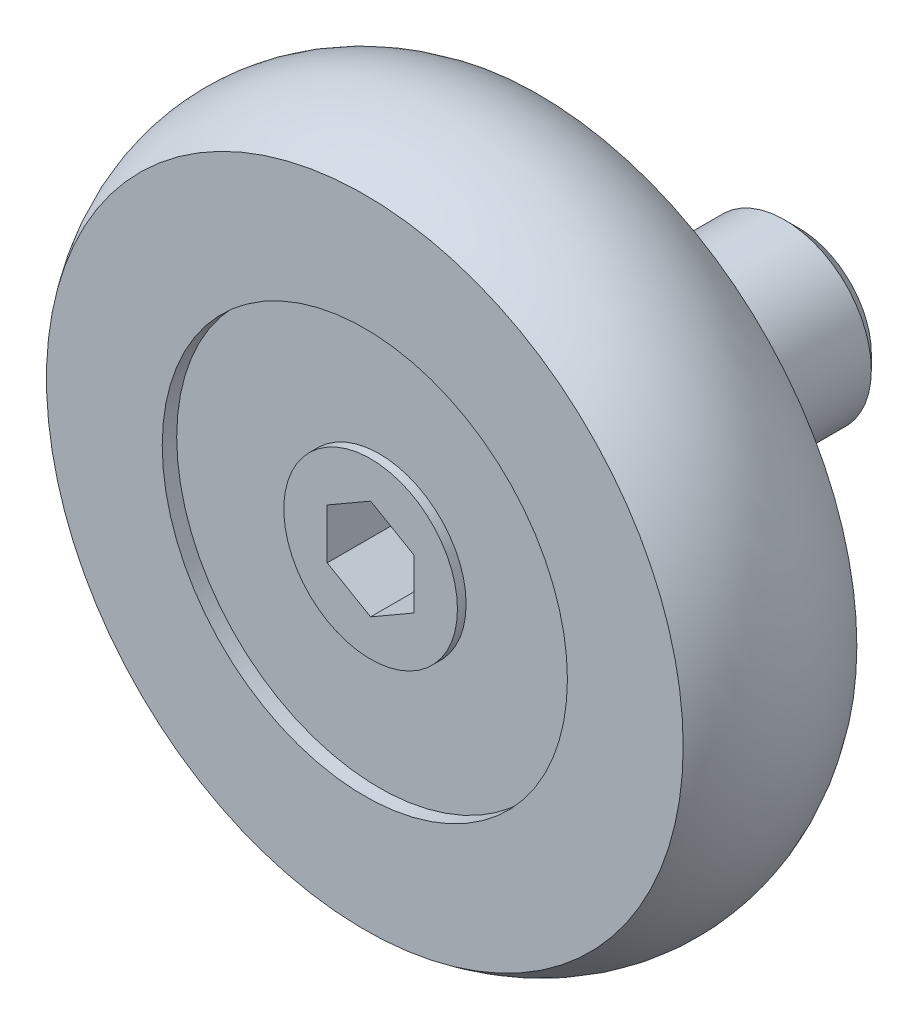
ISO-10303-21;
HEADER;
FILE_DESCRIPTION(('STEP AP214'),'2;1');
FILE_NAME('part.step','',(''),(''),'','','');
FILE_SCHEMA(('AUTOMOTIVE_DESIGN { 1 0 10303 214 1 1 1 1 }'));
ENDSEC;
DATA;
#1=APPLICATION_CONTEXT('core data for automotive mechanical design processes');
#2=APPLICATION_PROTOCOL_DEFINITION('international standard','automotive_design',2000,#1);
#3=PRODUCT_CONTEXT('',#1,'mechanical');
#4=PRODUCT('Part','Part','',(#3));
#5=PRODUCT_RELATED_PRODUCT_CATEGORY('part','',(#4));
#6=PRODUCT_DEFINITION_FORMATION('','',#4);
#7=PRODUCT_DEFINITION_CONTEXT('part definition',#1,'design');
#8=PRODUCT_DEFINITION('design','',#6,#7);
#9=PRODUCT_DEFINITION_SHAPE('','',#8);
#10=(LENGTH_UNIT() NAMED_UNIT(*) SI_UNIT(.MILLI.,.METRE.));
#11=(NAMED_UNIT(*) PLANE_ANGLE_UNIT() SI_UNIT($,.RADIAN.));
#12=(NAMED_UNIT(*) SI_UNIT($,.STERADIAN.) SOLID_ANGLE_UNIT());
#13=UNCERTAINTY_MEASURE_WITH_UNIT(LENGTH_MEASURE(1.E-05),#10,'distance_accuracy_value','');
#14=(GEOMETRIC_REPRESENTATION_CONTEXT(3) GLOBAL_UNCERTAINTY_ASSIGNED_CONTEXT((#13)) GLOBAL_UNIT_ASSIGNED_CONTEXT((#10,
#11,#12)) REPRESENTATION_CONTEXT('',''));
#15=CARTESIAN_POINT('',(0.,0.,0.));
#16=DIRECTION('',(0.,0.,1.));
#17=DIRECTION('',(1.,0.,0.));
#18=AXIS2_PLACEMENT_3D('',#15,#16,#17);
#19=CARTESIAN_POINT('',(0.,0.,-8.));
#20=DIRECTION('',(0.,0.,1.));
#21=DIRECTION('',(1.,0.,0.));
#22=AXIS2_PLACEMENT_3D('',#19,#20,#21);
#23=PLANE('',#22);
#24=CARTESIAN_POINT('',(0.,0.,-8.));
#25=DIRECTION('',(0.,0.,1.));
#26=DIRECTION('',(1.,0.,0.));
#27=AXIS2_PLACEMENT_3D('',#24,#25,#26);
#28=CIRCLE('',#27,2.5);
#29=CARTESIAN_POINT('',(2.5,0.,-8.));
#30=VERTEX_POINT('',#29);
#31=EDGE_CURVE('E9',#30,#30,#28,.T.);
#32=ORIENTED_EDGE('',*,*,#31,.F.);
#33=EDGE_LOOP('',(#32));
#34=FACE_BOUND('',#33,.T.);
#35=ADVANCED_FACE('F14',(#34),#23,.F.);
#36=CARTESIAN_POINT('',(0.,0.,-8.));
#37=DIRECTION('',(0.,0.,1.));
#38=DIRECTION('',(1.,0.,0.));
#39=AXIS2_PLACEMENT_3D('',#36,#37,#38);
#40=CONICAL_SURFACE('',#39,2.5,0.785398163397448);
#41=CARTESIAN_POINT('',(0.,0.,-7.5));
#42=DIRECTION('',(0.,0.,1.));
#43=DIRECTION('',(1.,0.,0.));
#44=AXIS2_PLACEMENT_3D('',#41,#42,#43);
#45=CIRCLE('',#44,3.);
#46=CARTESIAN_POINT('',(3.,0.,-7.5));
#47=VERTEX_POINT('',#46);
#48=EDGE_CURVE('E21',#47,#47,#45,.T.);
#49=ORIENTED_EDGE('',*,*,#48,.F.);
#50=EDGE_LOOP('',(#49));
#51=FACE_BOUND('',#50,.T.);
#52=ORIENTED_EDGE('',*,*,#31,.T.);
#53=EDGE_LOOP('',(#52));
#54=FACE_BOUND('',#53,.T.);
#55=ADVANCED_FACE('F163',(#51,#54),#40,.T.);
#56=CARTESIAN_POINT('',(0.,0.,10.));
#57=DIRECTION('',(0.,0.,1.));
#58=DIRECTION('',(1.,0.,0.));
#59=AXIS2_PLACEMENT_3D('',#56,#57,#58);
#60=CYLINDRICAL_SURFACE('',#59,3.);
#61=CARTESIAN_POINT('',(0.,0.,-2.));
#62=DIRECTION('',(0.,0.,1.));
#63=DIRECTION('',(1.,0.,0.));
#64=AXIS2_PLACEMENT_3D('',#61,#62,#63);
#65=CIRCLE('',#64,3.);
#66=CARTESIAN_POINT('',(3.,0.,-2.));
#67=VERTEX_POINT('',#66);
#68=EDGE_CURVE('E156',#67,#67,#65,.T.);
#69=ORIENTED_EDGE('',*,*,#68,.F.);
#70=EDGE_LOOP('',(#69));
#71=FACE_BOUND('',#70,.T.);
#72=ORIENTED_EDGE('',*,*,#48,.T.);
#73=EDGE_LOOP('',(#72));
#74=FACE_BOUND('',#73,.T.);
#75=ADVANCED_FACE('F161',(#71,#74),#60,.T.);
#76=CARTESIAN_POINT('',(0.,2.35,-2.));
#77=DIRECTION('',(0.,0.,-1.));
#78=DIRECTION('',(-1.,0.,0.));
#79=AXIS2_PLACEMENT_3D('',#76,#77,#78);
#80=PLANE('',#79);
#81=CARTESIAN_POINT('',(0.,0.,-2.));
#82=DIRECTION('',(0.,0.,1.));
#83=DIRECTION('',(1.,0.,0.));
#84=AXIS2_PLACEMENT_3D('',#81,#82,#83);
#85=CIRCLE('',#84,2.35);
#86=CARTESIAN_POINT('',(2.35,0.,-2.));
#87=VERTEX_POINT('',#86);
#88=EDGE_CURVE('E153',#87,#87,#85,.T.);
#89=ORIENTED_EDGE('',*,*,#88,.F.);
#90=EDGE_LOOP('',(#89));
#91=FACE_BOUND('',#90,.T.);
#92=ORIENTED_EDGE('',*,*,#68,.T.);
#93=EDGE_LOOP('',(#92));
#94=FACE_BOUND('',#93,.T.);
#95=ADVANCED_FACE('F188',(#91,#94),#80,.F.);
#96=CARTESIAN_POINT('',(0.,0.,10.));
#97=DIRECTION('',(0.,0.,1.));
#98=DIRECTION('',(1.,0.,0.));
#99=AXIS2_PLACEMENT_3D('',#96,#97,#98);
#100=CYLINDRICAL_SURFACE('',#99,2.35);
#101=CARTESIAN_POINT('',(0.,0.,0.));
#102=DIRECTION('',(0.,0.,1.));
#103=DIRECTION('',(1.,0.,0.));
#104=AXIS2_PLACEMENT_3D('',#101,#102,#103);
#105=CIRCLE('',#104,2.35);
#106=CARTESIAN_POINT('',(2.35,0.,0.));
#107=VERTEX_POINT('',#106);
#108=EDGE_CURVE('E150',#107,#107,#105,.T.);
#109=ORIENTED_EDGE('',*,*,#108,.F.);
#110=EDGE_LOOP('',(#109));
#111=FACE_BOUND('',#110,.T.);
#112=ORIENTED_EDGE('',*,*,#88,.T.);
#113=EDGE_LOOP('',(#112));
#114=FACE_BOUND('',#113,.T.);
#115=ADVANCED_FACE('F197',(#111,#114),#100,.T.);
#116=CARTESIAN_POINT('',(0.,4.,0.));
#117=DIRECTION('',(0.,0.,1.));
#118=DIRECTION('',(1.,0.,0.));
#119=AXIS2_PLACEMENT_3D('',#116,#117,#118);
#120=PLANE('',#119);
#121=CARTESIAN_POINT('',(0.,0.,0.));
#122=DIRECTION('',(0.,0.,1.));
#123=DIRECTION('',(1.,0.,0.));
#124=AXIS2_PLACEMENT_3D('',#121,#122,#123);
#125=CIRCLE('',#124,4.);
#126=CARTESIAN_POINT('',(4.,0.,0.));
#127=VERTEX_POINT('',#126);
#128=EDGE_CURVE('E147',#127,#127,#125,.T.);
#129=ORIENTED_EDGE('',*,*,#128,.F.);
#130=EDGE_LOOP('',(#129));
#131=FACE_BOUND('',#130,.T.);
#132=ORIENTED_EDGE('',*,*,#108,.T.);
#133=EDGE_LOOP('',(#132));
#134=FACE_BOUND('',#133,.T.);
#135=ADVANCED_FACE('F206',(#131,#134),#120,.F.);
#136=CARTESIAN_POINT('',(0.,0.,10.));
#137=DIRECTION('',(0.,0.,1.));
#138=DIRECTION('',(1.,0.,0.));
#139=AXIS2_PLACEMENT_3D('',#136,#137,#138);
#140=CYLINDRICAL_SURFACE('',#139,4.);
#141=CARTESIAN_POINT('',(0.,0.,1.5));
#142=DIRECTION('',(0.,0.,1.));
#143=DIRECTION('',(1.,0.,0.));
#144=AXIS2_PLACEMENT_3D('',#141,#142,#143);
#145=CIRCLE('',#144,4.);
#146=CARTESIAN_POINT('',(4.,0.,1.5));
#147=VERTEX_POINT('',#146);
#148=EDGE_CURVE('E144',#147,#147,#145,.T.);
#149=ORIENTED_EDGE('',*,*,#148,.F.);
#150=EDGE_LOOP('',(#149));
#151=FACE_BOUND('',#150,.T.);
#152=ORIENTED_EDGE('',*,*,#128,.T.);
#153=EDGE_LOOP('',(#152));
#154=FACE_BOUND('',#153,.T.);
#155=ADVANCED_FACE('F215',(#151,#154),#140,.T.);
#156=CARTESIAN_POINT('',(0.,4.,1.5));
#157=DIRECTION('',(0.,0.,1.));
#158=DIRECTION('',(1.,0.,0.));
#159=AXIS2_PLACEMENT_3D('',#156,#157,#158);
#160=PLANE('',#159);
#161=CARTESIAN_POINT('',(0.,0.,1.5));
#162=DIRECTION('',(0.,0.,1.));
#163=DIRECTION('',(1.,0.,0.));
#164=AXIS2_PLACEMENT_3D('',#161,#162,#163);
#165=CIRCLE('',#164,7.);
#166=CARTESIAN_POINT('',(7.,0.,1.5));
#167=VERTEX_POINT('',#166);
#168=EDGE_CURVE('E141',#167,#167,#165,.T.);
#169=ORIENTED_EDGE('',*,*,#168,.F.);
#170=EDGE_LOOP('',(#169));
#171=FACE_BOUND('',#170,.T.);
#172=ORIENTED_EDGE('',*,*,#148,.T.);
#173=EDGE_LOOP('',(#172));
#174=FACE_BOUND('',#173,.T.);
#175=ADVANCED_FACE('F224',(#171,#174),#160,.F.);
#176=CARTESIAN_POINT('',(0.,0.,10.));
#177=DIRECTION('',(0.,0.,1.));
#178=DIRECTION('',(1.,0.,0.));
#179=AXIS2_PLACEMENT_3D('',#176,#177,#178);
#180=CYLINDRICAL_SURFACE('',#179,7.);
#181=CARTESIAN_POINT('',(0.,0.,1.00000000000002));
#182=DIRECTION('',(0.,0.,1.));
#183=DIRECTION('',(1.,0.,0.));
#184=AXIS2_PLACEMENT_3D('',#181,#182,#183);
#185=CIRCLE('',#184,7.);
#186=CARTESIAN_POINT('',(7.,0.,1.00000000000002));
#187=VERTEX_POINT('',#186);
#188=EDGE_CURVE('E138',#187,#187,#185,.T.);
#189=ORIENTED_EDGE('',*,*,#188,.F.);
#190=EDGE_LOOP('',(#189));
#191=FACE_BOUND('',#190,.T.);
#192=ORIENTED_EDGE('',*,*,#168,.T.);
#193=EDGE_LOOP('',(#192));
#194=FACE_BOUND('',#193,.T.);
#195=ADVANCED_FACE('F233',(#191,#194),#180,.F.);
#196=CARTESIAN_POINT('',(0.,11.,1.00000000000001));
#197=DIRECTION('',(0.,0.,1.));
#198=DIRECTION('',(1.,0.,0.));
#199=AXIS2_PLACEMENT_3D('',#196,#197,#198);
#200=PLANE('',#199);
#201=CARTESIAN_POINT('',(0.,0.,1.));
#202=DIRECTION('',(0.,0.,1.));
#203=DIRECTION('',(1.,0.,0.));
#204=AXIS2_PLACEMENT_3D('',#201,#202,#203);
#205=CIRCLE('',#204,11.);
#206=CARTESIAN_POINT('',(11.,0.,1.));
#207=VERTEX_POINT('',#206);
#208=EDGE_CURVE('E135',#207,#207,#205,.T.);
#209=ORIENTED_EDGE('',*,*,#208,.F.);
#210=EDGE_LOOP('',(#209));
#211=FACE_BOUND('',#210,.T.);
#212=ORIENTED_EDGE('',*,*,#188,.T.);
#213=EDGE_LOOP('',(#212));
#214=FACE_BOUND('',#213,.T.);
#215=ADVANCED_FACE('F242',(#211,#214),#200,.F.);
#216=CARTESIAN_POINT('',(0.,0.,4.));
#217=DIRECTION('',(0.,0.,1.));
#218=DIRECTION('',(1.,0.,0.));
#219=AXIS2_PLACEMENT_3D('',#216,#217,#218);
#220=TOROIDAL_SURFACE('',#219,7.,5.);
#221=CARTESIAN_POINT('',(0.,0.,7.));
#222=DIRECTION('',(0.,0.,1.));
#223=DIRECTION('',(1.,0.,0.));
#224=AXIS2_PLACEMENT_3D('',#221,#222,#223);
#225=CIRCLE('',#224,11.);
#226=CARTESIAN_POINT('',(11.,0.,7.));
#227=VERTEX_POINT('',#226);
#228=EDGE_CURVE('E132',#227,#227,#225,.T.);
#229=ORIENTED_EDGE('',*,*,#228,.F.);
#230=EDGE_LOOP('',(#229));
#231=FACE_BOUND('',#230,.T.);
#232=ORIENTED_EDGE('',*,*,#208,.T.);
#233=EDGE_LOOP('',(#232));
#234=FACE_BOUND('',#233,.T.);
#235=ADVANCED_FACE('F251',(#231,#234),#220,.T.);
#236=CARTESIAN_POINT('',(0.,11.,7.));
#237=DIRECTION('',(0.,0.,-1.));
#238=DIRECTION('',(-1.,0.,0.));
#239=AXIS2_PLACEMENT_3D('',#236,#237,#238);
#240=PLANE('',#239);
#241=CARTESIAN_POINT('',(0.,0.,7.));
#242=DIRECTION('',(0.,0.,1.));
#243=DIRECTION('',(1.,0.,0.));
#244=AXIS2_PLACEMENT_3D('',#241,#242,#243);
#245=CIRCLE('',#244,7.);
#246=CARTESIAN_POINT('',(7.,0.,7.));
#247=VERTEX_POINT('',#246);
#248=EDGE_CURVE('E129',#247,#247,#245,.T.);
#249=ORIENTED_EDGE('',*,*,#248,.F.);
#250=EDGE_LOOP('',(#249));
#251=FACE_BOUND('',#250,.T.);
#252=ORIENTED_EDGE('',*,*,#228,.T.);
#253=EDGE_LOOP('',(#252));
#254=FACE_BOUND('',#253,.T.);
#255=ADVANCED_FACE('F260',(#251,#254),#240,.F.);
#256=CARTESIAN_POINT('',(0.,0.,10.));
#257=DIRECTION('',(0.,0.,1.));
#258=DIRECTION('',(1.,0.,0.));
#259=AXIS2_PLACEMENT_3D('',#256,#257,#258);
#260=CYLINDRICAL_SURFACE('',#259,7.);
#261=CARTESIAN_POINT('',(0.,0.,6.5));
#262=DIRECTION('',(0.,0.,1.));
#263=DIRECTION('',(1.,0.,0.));
#264=AXIS2_PLACEMENT_3D('',#261,#262,#263);
#265=CIRCLE('',#264,7.);
#266=CARTESIAN_POINT('',(7.,0.,6.5));
#267=VERTEX_POINT('',#266);
#268=EDGE_CURVE('E126',#267,#267,#265,.T.);
#269=ORIENTED_EDGE('',*,*,#268,.F.);
#270=EDGE_LOOP('',(#269));
#271=FACE_BOUND('',#270,.T.);
#272=ORIENTED_EDGE('',*,*,#248,.T.);
#273=EDGE_LOOP('',(#272));
#274=FACE_BOUND('',#273,.T.);
#275=ADVANCED_FACE('F269',(#271,#274),#260,.F.);
#276=CARTESIAN_POINT('',(0.,3.,6.5));
#277=DIRECTION('',(0.,0.,-1.));
#278=DIRECTION('',(-1.,0.,0.));
#279=AXIS2_PLACEMENT_3D('',#276,#277,#278);
#280=PLANE('',#279);
#281=CARTESIAN_POINT('',(0.,0.,6.5));
#282=DIRECTION('',(0.,0.,1.));
#283=DIRECTION('',(1.,0.,0.));
#284=AXIS2_PLACEMENT_3D('',#281,#282,#283);
#285=CIRCLE('',#284,3.);
#286=CARTESIAN_POINT('',(3.,0.,6.5));
#287=VERTEX_POINT('',#286);
#288=EDGE_CURVE('E123',#287,#287,#285,.T.);
#289=ORIENTED_EDGE('',*,*,#288,.F.);
#290=EDGE_LOOP('',(#289));
#291=FACE_BOUND('',#290,.T.);
#292=ORIENTED_EDGE('',*,*,#268,.T.);
#293=EDGE_LOOP('',(#292));
#294=FACE_BOUND('',#293,.T.);
#295=ADVANCED_FACE('F278',(#291,#294),#280,.F.);
#296=CARTESIAN_POINT('',(0.,0.,10.));
#297=DIRECTION('',(0.,0.,1.));
#298=DIRECTION('',(1.,0.,0.));
#299=AXIS2_PLACEMENT_3D('',#296,#297,#298);
#300=CYLINDRICAL_SURFACE('',#299,3.);
#301=CARTESIAN_POINT('',(0.,0.,6.8));
#302=DIRECTION('',(0.,0.,1.));
#303=DIRECTION('',(1.,0.,0.));
#304=AXIS2_PLACEMENT_3D('',#301,#302,#303);
#305=CIRCLE('',#304,3.);
#306=CARTESIAN_POINT('',(3.,0.,6.8));
#307=VERTEX_POINT('',#306);
#308=EDGE_CURVE('E115',#307,#307,#305,.T.);
#309=ORIENTED_EDGE('',*,*,#308,.F.);
#310=EDGE_LOOP('',(#309));
#311=FACE_BOUND('',#310,.T.);
#312=ORIENTED_EDGE('',*,*,#288,.T.);
#313=EDGE_LOOP('',(#312));
#314=FACE_BOUND('',#313,.T.);
#315=ADVANCED_FACE('F287',(#311,#314),#300,.T.);
#316=CARTESIAN_POINT('',(0.,3.,6.8));
#317=DIRECTION('',(0.,0.,-1.));
#318=DIRECTION('',(-1.,0.,0.));
#319=AXIS2_PLACEMENT_3D('',#316,#317,#318);
#320=PLANE('',#319);
#321=DIRECTION('',(-0.866025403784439,-0.5,0.));
#322=VECTOR('',#321,1.);
#323=CARTESIAN_POINT('',(0.,1.73205080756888,6.8));
#324=LINE('',#323,#322);
#325=CARTESIAN_POINT('',(0.,1.73205080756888,6.8));
#326=VERTEX_POINT('',#325);
#327=CARTESIAN_POINT('',(-1.5,0.866025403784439,6.8));
#328=VERTEX_POINT('',#327);
#329=EDGE_CURVE('E102',#326,#328,#324,.T.);
#330=ORIENTED_EDGE('',*,*,#329,.F.);
#331=DIRECTION('',(-0.866025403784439,0.5,0.));
#332=VECTOR('',#331,1.);
#333=CARTESIAN_POINT('',(1.5,0.86602540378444,6.8));
#334=LINE('',#333,#332);
#335=CARTESIAN_POINT('',(1.5,0.86602540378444,6.8));
#336=VERTEX_POINT('',#335);
#337=EDGE_CURVE('E28',#336,#326,#334,.T.);
#338=ORIENTED_EDGE('',*,*,#337,.F.);
#339=DIRECTION('',(0.,1.,0.));
#340=VECTOR('',#339,1.);
#341=CARTESIAN_POINT('',(1.5,-0.866025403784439,6.8));
#342=LINE('',#341,#340);
#343=CARTESIAN_POINT('',(1.5,-0.866025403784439,6.8));
#344=VERTEX_POINT('',#343);
#345=EDGE_CURVE('E111',#344,#336,#342,.T.);
#346=ORIENTED_EDGE('',*,*,#345,.F.);
#347=DIRECTION('',(0.866025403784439,0.5,0.));
#348=VECTOR('',#347,1.);
#349=CARTESIAN_POINT('',(0.,-1.73205080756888,6.8));
#350=LINE('',#349,#348);
#351=CARTESIAN_POINT('',(0.,-1.73205080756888,6.8));
#352=VERTEX_POINT('',#351);
#353=EDGE_CURVE('E109',#352,#344,#350,.T.);
#354=ORIENTED_EDGE('',*,*,#353,.F.);
#355=DIRECTION('',(0.866025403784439,-0.5,0.));
#356=VECTOR('',#355,1.);
#357=CARTESIAN_POINT('',(-1.5,-0.866025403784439,6.8));
#358=LINE('',#357,#356);
#359=CARTESIAN_POINT('',(-1.5,-0.866025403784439,6.8));
#360=VERTEX_POINT('',#359);
#361=EDGE_CURVE('E76',#360,#352,#358,.T.);
#362=ORIENTED_EDGE('',*,*,#361,.F.);
#363=DIRECTION('',(0.,-1.,0.));
#364=VECTOR('',#363,1.);
#365=CARTESIAN_POINT('',(-1.5,0.866025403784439,6.8));
#366=LINE('',#365,#364);
#367=EDGE_CURVE('E105',#328,#360,#366,.T.);
#368=ORIENTED_EDGE('',*,*,#367,.F.);
#369=EDGE_LOOP('',(#330,#338,#346,#354,#362,#368));
#370=FACE_BOUND('',#369,.T.);
#371=ORIENTED_EDGE('',*,*,#308,.T.);
#372=EDGE_LOOP('',(#371));
#373=FACE_BOUND('',#372,.T.);
#374=ADVANCED_FACE('F296',(#370,#373),#320,.F.);
#375=CARTESIAN_POINT('',(1.5,0.86602540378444,4.3));
#376=DIRECTION('',(0.5,0.866025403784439,0.));
#377=DIRECTION('',(-0.866025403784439,0.5,0.));
#378=AXIS2_PLACEMENT_3D('',#375,#376,#377);
#379=PLANE('',#378);
#380=ORIENTED_EDGE('',*,*,#337,.T.);
#381=DIRECTION('',(0.,0.,1.));
#382=VECTOR('',#381,1.);
#383=CARTESIAN_POINT('',(0.,1.73205080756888,4.3));
#384=LINE('',#383,#382);
#385=CARTESIAN_POINT('',(0.,1.73205080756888,4.3));
#386=VERTEX_POINT('',#385);
#387=EDGE_CURVE('E58',#386,#326,#384,.T.);
#388=ORIENTED_EDGE('',*,*,#387,.F.);
#389=DIRECTION('',(-0.866025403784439,0.5,0.));
#390=VECTOR('',#389,1.);
#391=CARTESIAN_POINT('',(1.5,0.86602540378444,4.3));
#392=LINE('',#391,#390);
#393=CARTESIAN_POINT('',(1.5,0.86602540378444,4.3));
#394=VERTEX_POINT('',#393);
#395=EDGE_CURVE('E113',#394,#386,#392,.T.);
#396=ORIENTED_EDGE('',*,*,#395,.F.);
#397=DIRECTION('',(0.,0.,1.));
#398=VECTOR('',#397,1.);
#399=CARTESIAN_POINT('',(1.5,0.86602540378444,4.3));
#400=LINE('',#399,#398);
#401=EDGE_CURVE('E36',#394,#336,#400,.T.);
#402=ORIENTED_EDGE('',*,*,#401,.T.);
#403=EDGE_LOOP('',(#380,#388,#396,#402));
#404=FACE_BOUND('',#403,.T.);
#405=ADVANCED_FACE('F305',(#404),#379,.F.);
#406=CARTESIAN_POINT('',(1.5,-0.866025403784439,4.3));
#407=DIRECTION('',(1.,0.,0.));
#408=DIRECTION('',(0.,1.,0.));
#409=AXIS2_PLACEMENT_3D('',#406,#407,#408);
#410=PLANE('',#409);
#411=ORIENTED_EDGE('',*,*,#345,.T.);
#412=ORIENTED_EDGE('',*,*,#401,.F.);
#413=DIRECTION('',(0.,1.,0.));
#414=VECTOR('',#413,1.);
#415=CARTESIAN_POINT('',(1.5,-0.866025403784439,4.3));
#416=LINE('',#415,#414);
#417=CARTESIAN_POINT('',(1.5,-0.866025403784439,4.3));
#418=VERTEX_POINT('',#417);
#419=EDGE_CURVE('E88',#418,#394,#416,.T.);
#420=ORIENTED_EDGE('',*,*,#419,.F.);
#421=DIRECTION('',(0.,0.,1.));
#422=VECTOR('',#421,1.);
#423=CARTESIAN_POINT('',(1.5,-0.866025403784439,4.3));
#424=LINE('',#423,#422);
#425=EDGE_CURVE('E80',#418,#344,#424,.T.);
#426=ORIENTED_EDGE('',*,*,#425,.T.);
#427=EDGE_LOOP('',(#411,#412,#420,#426));
#428=FACE_BOUND('',#427,.T.);
#429=ADVANCED_FACE('F314',(#428),#410,.F.);
#430=CARTESIAN_POINT('',(0.,-1.73205080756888,4.3));
#431=DIRECTION('',(0.5,-0.866025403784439,0.));
#432=DIRECTION('',(0.866025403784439,0.5,0.));
#433=AXIS2_PLACEMENT_3D('',#430,#431,#432);
#434=PLANE('',#433);
#435=ORIENTED_EDGE('',*,*,#353,.T.);
#436=ORIENTED_EDGE('',*,*,#425,.F.);
#437=DIRECTION('',(0.866025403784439,0.5,0.));
#438=VECTOR('',#437,1.);
#439=CARTESIAN_POINT('',(0.,-1.73205080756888,4.3));
#440=LINE('',#439,#438);
#441=CARTESIAN_POINT('',(0.,-1.73205080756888,4.3));
#442=VERTEX_POINT('',#441);
#443=EDGE_CURVE('E84',#442,#418,#440,.T.);
#444=ORIENTED_EDGE('',*,*,#443,.F.);
#445=DIRECTION('',(0.,0.,1.));
#446=VECTOR('',#445,1.);
#447=CARTESIAN_POINT('',(0.,-1.73205080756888,4.3));
#448=LINE('',#447,#446);
#449=EDGE_CURVE('E69',#442,#352,#448,.T.);
#450=ORIENTED_EDGE('',*,*,#449,.T.);
#451=EDGE_LOOP('',(#435,#436,#444,#450));
#452=FACE_BOUND('',#451,.T.);
#453=ADVANCED_FACE('F85',(#452),#434,.F.);
#454=CARTESIAN_POINT('',(-1.5,-0.866025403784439,4.3));
#455=DIRECTION('',(-0.5,-0.866025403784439,0.));
#456=DIRECTION('',(0.866025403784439,-0.5,0.));
#457=AXIS2_PLACEMENT_3D('',#454,#455,#456);
#458=PLANE('',#457);
#459=ORIENTED_EDGE('',*,*,#361,.T.);
#460=ORIENTED_EDGE('',*,*,#449,.F.);
#461=DIRECTION('',(0.866025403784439,-0.5,0.));
#462=VECTOR('',#461,1.);
#463=CARTESIAN_POINT('',(-1.5,-0.866025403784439,4.3));
#464=LINE('',#463,#462);
#465=CARTESIAN_POINT('',(-1.5,-0.866025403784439,4.3));
#466=VERTEX_POINT('',#465);
#467=EDGE_CURVE('E73',#466,#442,#464,.T.);
#468=ORIENTED_EDGE('',*,*,#467,.F.);
#469=DIRECTION('',(0.,0.,1.));
#470=VECTOR('',#469,1.);
#471=CARTESIAN_POINT('',(-1.5,-0.866025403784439,4.3));
#472=LINE('',#471,#470);
#473=EDGE_CURVE('E81',#466,#360,#472,.T.);
#474=ORIENTED_EDGE('',*,*,#473,.T.);
#475=EDGE_LOOP('',(#459,#460,#468,#474));
#476=FACE_BOUND('',#475,.T.);
#477=ADVANCED_FACE('F71',(#476),#458,.F.);
#478=CARTESIAN_POINT('',(-1.5,0.866025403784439,4.3));
#479=DIRECTION('',(-1.,0.,0.));
#480=DIRECTION('',(0.,-1.,0.));
#481=AXIS2_PLACEMENT_3D('',#478,#479,#480);
#482=PLANE('',#481);
#483=ORIENTED_EDGE('',*,*,#367,.T.);
#484=ORIENTED_EDGE('',*,*,#473,.F.);
#485=DIRECTION('',(0.,-1.,0.));
#486=VECTOR('',#485,1.);
#487=CARTESIAN_POINT('',(-1.5,0.866025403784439,4.3));
#488=LINE('',#487,#486);
#489=CARTESIAN_POINT('',(-1.5,0.866025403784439,4.3));
#490=VERTEX_POINT('',#489);
#491=EDGE_CURVE('E94',#490,#466,#488,.T.);
#492=ORIENTED_EDGE('',*,*,#491,.F.);
#493=DIRECTION('',(0.,0.,1.));
#494=VECTOR('',#493,1.);
#495=CARTESIAN_POINT('',(-1.5,0.866025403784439,4.3));
#496=LINE('',#495,#494);
#497=EDGE_CURVE('E118',#490,#328,#496,.T.);
#498=ORIENTED_EDGE('',*,*,#497,.T.);
#499=EDGE_LOOP('',(#483,#484,#492,#498));
#500=FACE_BOUND('',#499,.T.);
#501=ADVANCED_FACE('F336',(#500),#482,.F.);
#502=CARTESIAN_POINT('',(0.,1.73205080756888,4.3));
#503=DIRECTION('',(-0.5,0.866025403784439,0.));
#504=DIRECTION('',(-0.866025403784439,-0.5,0.));
#505=AXIS2_PLACEMENT_3D('',#502,#503,#504);
#506=PLANE('',#505);
#507=ORIENTED_EDGE('',*,*,#329,.T.);
#508=ORIENTED_EDGE('',*,*,#497,.F.);
#509=DIRECTION('',(-0.866025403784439,-0.5,0.));
#510=VECTOR('',#509,1.);
#511=CARTESIAN_POINT('',(0.,1.73205080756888,4.3));
#512=LINE('',#511,#510);
#513=EDGE_CURVE('E96',#386,#490,#512,.T.);
#514=ORIENTED_EDGE('',*,*,#513,.F.);
#515=ORIENTED_EDGE('',*,*,#387,.T.);
#516=EDGE_LOOP('',(#507,#508,#514,#515));
#517=FACE_BOUND('',#516,.T.);
#518=ADVANCED_FACE('F344',(#517),#506,.F.);
#519=CARTESIAN_POINT('',(0.,0.,4.3));
#520=DIRECTION('',(0.,0.,1.));
#521=DIRECTION('',(1.,0.,0.));
#522=AXIS2_PLACEMENT_3D('',#519,#520,#521);
#523=PLANE('',#522);
#524=ORIENTED_EDGE('',*,*,#395,.T.);
#525=ORIENTED_EDGE('',*,*,#513,.T.);
#526=ORIENTED_EDGE('',*,*,#491,.T.);
#527=ORIENTED_EDGE('',*,*,#467,.T.);
#528=ORIENTED_EDGE('',*,*,#443,.T.);
#529=ORIENTED_EDGE('',*,*,#419,.T.);
#530=EDGE_LOOP('',(#524,#525,#526,#527,#528,#529));
#531=FACE_BOUND('',#530,.T.);
#532=ADVANCED_FACE('F91',(#531),#523,.T.);
#533=CLOSED_SHELL('',(#35,#55,#75,#95,#115,#135,#155,#175,#195,#215,#235,#255,#275,#295,#315,
#374,#405,#429,#453,#477,#501,#518,#532));
#534=MANIFOLD_SOLID_BREP('B1',#533);
#535=ADVANCED_BREP_SHAPE_REPRESENTATION('',(#18,#534),#14);
#536=SHAPE_DEFINITION_REPRESENTATION(#9,#535);
ENDSEC;
END-ISO-10303-21;
